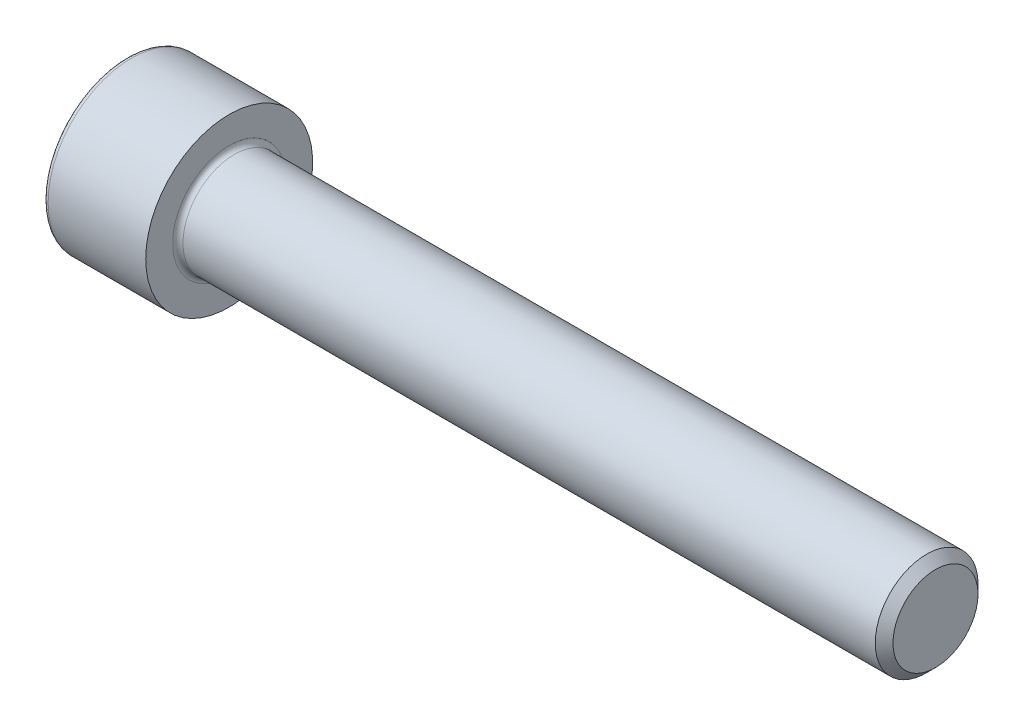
ISO-10303-21;
HEADER;
FILE_DESCRIPTION(('STEP AP214'),'2;1');
FILE_NAME('part.step','',(''),(''),'','','');
FILE_SCHEMA(('AUTOMOTIVE_DESIGN { 1 0 10303 214 1 1 1 1 }'));
ENDSEC;
DATA;
#1=APPLICATION_CONTEXT('core data for automotive mechanical design processes');
#2=APPLICATION_PROTOCOL_DEFINITION('international standard','automotive_design',2000,#1);
#3=PRODUCT_CONTEXT('',#1,'mechanical');
#4=PRODUCT('Part','Part','',(#3));
#5=PRODUCT_RELATED_PRODUCT_CATEGORY('part','',(#4));
#6=PRODUCT_DEFINITION_FORMATION('','',#4);
#7=PRODUCT_DEFINITION_CONTEXT('part definition',#1,'design');
#8=PRODUCT_DEFINITION('design','',#6,#7);
#9=PRODUCT_DEFINITION_SHAPE('','',#8);
#10=(LENGTH_UNIT() NAMED_UNIT(*) SI_UNIT(.MILLI.,.METRE.));
#11=(NAMED_UNIT(*) PLANE_ANGLE_UNIT() SI_UNIT($,.RADIAN.));
#12=(NAMED_UNIT(*) SI_UNIT($,.STERADIAN.) SOLID_ANGLE_UNIT());
#13=UNCERTAINTY_MEASURE_WITH_UNIT(LENGTH_MEASURE(1.E-05),#10,'distance_accuracy_value','');
#14=(GEOMETRIC_REPRESENTATION_CONTEXT(3) GLOBAL_UNCERTAINTY_ASSIGNED_CONTEXT((#13)) GLOBAL_UNIT_ASSIGNED_CONTEXT((#10,
#11,#12)) REPRESENTATION_CONTEXT('',''));
#15=CARTESIAN_POINT('',(0.,0.,0.));
#16=DIRECTION('',(0.,0.,1.));
#17=DIRECTION('',(1.,0.,0.));
#18=AXIS2_PLACEMENT_3D('',#15,#16,#17);
#19=CARTESIAN_POINT('',(0.,0.,0.));
#20=DIRECTION('',(-1.,0.,0.));
#21=DIRECTION('',(0.,0.,1.));
#22=AXIS2_PLACEMENT_3D('',#19,#20,#21);
#23=PLANE('',#22);
#24=DIRECTION('',(0.,-0.499999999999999,0.866025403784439));
#25=VECTOR('',#24,1.);
#26=CARTESIAN_POINT('',(0.,3.51894989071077,0.));
#27=LINE('',#26,#25);
#28=CARTESIAN_POINT('',(0.,3.51894989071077,0.));
#29=VERTEX_POINT('',#28);
#30=CARTESIAN_POINT('',(0.,1.75947494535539,3.04749999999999));
#31=VERTEX_POINT('',#30);
#32=EDGE_CURVE('E264',#29,#31,#27,.T.);
#33=ORIENTED_EDGE('',*,*,#32,.T.);
#34=DIRECTION('',(0.,1.,0.));
#35=VECTOR('',#34,1.);
#36=CARTESIAN_POINT('',(0.,-1.75947494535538,3.04749999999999));
#37=LINE('',#36,#35);
#38=CARTESIAN_POINT('',(0.,-1.75947494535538,3.04749999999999));
#39=VERTEX_POINT('',#38);
#40=EDGE_CURVE('E136',#39,#31,#37,.T.);
#41=ORIENTED_EDGE('',*,*,#40,.F.);
#42=DIRECTION('',(0.,-0.500000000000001,-0.866025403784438));
#43=VECTOR('',#42,1.);
#44=CARTESIAN_POINT('',(0.,-1.75947494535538,3.04749999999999));
#45=LINE('',#44,#43);
#46=CARTESIAN_POINT('',(0.,-3.51894989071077,0.));
#47=VERTEX_POINT('',#46);
#48=EDGE_CURVE('E267',#39,#47,#45,.T.);
#49=ORIENTED_EDGE('',*,*,#48,.T.);
#50=DIRECTION('',(0.,0.499999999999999,-0.866025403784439));
#51=VECTOR('',#50,1.);
#52=CARTESIAN_POINT('',(0.,-3.51894989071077,0.));
#53=LINE('',#52,#51);
#54=CARTESIAN_POINT('',(0.,-1.75947494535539,-3.04750000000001));
#55=VERTEX_POINT('',#54);
#56=EDGE_CURVE('E270',#47,#55,#53,.T.);
#57=ORIENTED_EDGE('',*,*,#56,.T.);
#58=DIRECTION('',(0.,-1.,0.));
#59=VECTOR('',#58,1.);
#60=CARTESIAN_POINT('',(0.,1.75947494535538,-3.04750000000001));
#61=LINE('',#60,#59);
#62=CARTESIAN_POINT('',(0.,1.75947494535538,-3.04750000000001));
#63=VERTEX_POINT('',#62);
#64=EDGE_CURVE('E273',#63,#55,#61,.T.);
#65=ORIENTED_EDGE('',*,*,#64,.F.);
#66=DIRECTION('',(0.,-0.500000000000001,-0.866025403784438));
#67=VECTOR('',#66,1.);
#68=CARTESIAN_POINT('',(0.,3.51894989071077,0.));
#69=LINE('',#68,#67);
#70=EDGE_CURVE('E131',#29,#63,#69,.T.);
#71=ORIENTED_EDGE('',*,*,#70,.F.);
#72=EDGE_LOOP('',(#33,#41,#49,#57,#65,#71));
#73=FACE_BOUND('',#72,.T.);
#74=CARTESIAN_POINT('',(0.,0.,0.));
#75=DIRECTION('',(-1.,0.,0.));
#76=DIRECTION('',(0.,0.,1.));
#77=AXIS2_PLACEMENT_3D('',#74,#75,#76);
#78=CIRCLE('',#77,6.1);
#79=CARTESIAN_POINT('',(0.,0.,6.1));
#80=VERTEX_POINT('',#79);
#81=EDGE_CURVE('E48',#80,#80,#78,.T.);
#82=ORIENTED_EDGE('',*,*,#81,.T.);
#83=EDGE_LOOP('',(#82));
#84=FACE_BOUND('',#83,.T.);
#85=ADVANCED_FACE('F40',(#73,#84),#23,.T.);
#86=CARTESIAN_POINT('',(-31.75,0.,0.));
#87=DIRECTION('',(-1.,0.,0.));
#88=DIRECTION('',(0.,0.,1.));
#89=AXIS2_PLACEMENT_3D('',#86,#87,#88);
#90=CYLINDRICAL_SURFACE('',#89,6.5);
#91=CARTESIAN_POINT('',(0.399999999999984,0.,0.));
#92=DIRECTION('',(-1.,0.,0.));
#93=DIRECTION('',(0.,0.,1.));
#94=AXIS2_PLACEMENT_3D('',#91,#92,#93);
#95=CIRCLE('',#94,6.5);
#96=CARTESIAN_POINT('',(0.399999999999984,0.,6.5));
#97=VERTEX_POINT('',#96);
#98=EDGE_CURVE('E11',#97,#97,#95,.F.);
#99=ORIENTED_EDGE('',*,*,#98,.T.);
#100=EDGE_LOOP('',(#99));
#101=FACE_BOUND('',#100,.T.);
#102=CARTESIAN_POINT('',(8.00000000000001,0.,0.));
#103=DIRECTION('',(-1.,0.,0.));
#104=DIRECTION('',(0.,0.,1.));
#105=AXIS2_PLACEMENT_3D('',#102,#103,#104);
#106=CIRCLE('',#105,6.5);
#107=CARTESIAN_POINT('',(8.00000000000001,0.,6.5));
#108=VERTEX_POINT('',#107);
#109=EDGE_CURVE('E154',#108,#108,#106,.T.);
#110=ORIENTED_EDGE('',*,*,#109,.T.);
#111=EDGE_LOOP('',(#110));
#112=FACE_BOUND('',#111,.T.);
#113=ADVANCED_FACE('F178',(#101,#112),#90,.T.);
#114=CARTESIAN_POINT('',(8.00000000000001,6.5,0.));
#115=DIRECTION('',(1.,0.,0.));
#116=DIRECTION('',(0.,0.,-1.));
#117=AXIS2_PLACEMENT_3D('',#114,#115,#116);
#118=PLANE('',#117);
#119=CARTESIAN_POINT('',(8.00000000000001,0.,0.));
#120=DIRECTION('',(1.,0.,0.));
#121=DIRECTION('',(0.,0.,-1.));
#122=AXIS2_PLACEMENT_3D('',#119,#120,#121);
#123=CIRCLE('',#122,4.4);
#124=CARTESIAN_POINT('',(8.00000000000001,0.,-4.4));
#125=VERTEX_POINT('',#124);
#126=EDGE_CURVE('E157',#125,#125,#123,.F.);
#127=ORIENTED_EDGE('',*,*,#126,.T.);
#128=EDGE_LOOP('',(#127));
#129=FACE_BOUND('',#128,.T.);
#130=ORIENTED_EDGE('',*,*,#109,.F.);
#131=EDGE_LOOP('',(#130));
#132=FACE_BOUND('',#131,.T.);
#133=ADVANCED_FACE('F184',(#129,#132),#118,.T.);
#134=CARTESIAN_POINT('',(-31.75,0.,0.));
#135=DIRECTION('',(-1.,0.,0.));
#136=DIRECTION('',(0.,0.,1.));
#137=AXIS2_PLACEMENT_3D('',#134,#135,#136);
#138=CYLINDRICAL_SURFACE('',#137,4.);
#139=CARTESIAN_POINT('',(8.39999999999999,0.,0.));
#140=DIRECTION('',(1.,0.,0.));
#141=DIRECTION('',(0.,0.,-1.));
#142=AXIS2_PLACEMENT_3D('',#139,#140,#141);
#143=CIRCLE('',#142,4.);
#144=CARTESIAN_POINT('',(8.39999999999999,0.,-4.));
#145=VERTEX_POINT('',#144);
#146=EDGE_CURVE('E160',#145,#145,#143,.T.);
#147=ORIENTED_EDGE('',*,*,#146,.T.);
#148=EDGE_LOOP('',(#147));
#149=FACE_BOUND('',#148,.T.);
#150=CARTESIAN_POINT('',(62.3095,0.,0.));
#151=DIRECTION('',(-1.,0.,0.));
#152=DIRECTION('',(0.,0.,1.));
#153=AXIS2_PLACEMENT_3D('',#150,#151,#152);
#154=CIRCLE('',#153,4.);
#155=CARTESIAN_POINT('',(62.3095,0.,4.));
#156=VERTEX_POINT('',#155);
#157=EDGE_CURVE('E151',#156,#156,#154,.T.);
#158=ORIENTED_EDGE('',*,*,#157,.T.);
#159=EDGE_LOOP('',(#158));
#160=FACE_BOUND('',#159,.T.);
#161=ADVANCED_FACE('F190',(#149,#160),#138,.T.);
#162=CARTESIAN_POINT('',(63.,0.,0.));
#163=DIRECTION('',(-1.,0.,0.));
#164=DIRECTION('',(0.,0.,1.));
#165=AXIS2_PLACEMENT_3D('',#162,#163,#164);
#166=CONICAL_SURFACE('',#165,3.3095,0.785398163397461);
#167=ORIENTED_EDGE('',*,*,#157,.F.);
#168=EDGE_LOOP('',(#167));
#169=FACE_BOUND('',#168,.T.);
#170=CARTESIAN_POINT('',(63.,0.,0.));
#171=DIRECTION('',(-1.,0.,0.));
#172=DIRECTION('',(0.,0.,1.));
#173=AXIS2_PLACEMENT_3D('',#170,#171,#172);
#174=CIRCLE('',#173,3.3095);
#175=CARTESIAN_POINT('',(63.,0.,3.3095));
#176=VERTEX_POINT('',#175);
#177=EDGE_CURVE('E147',#176,#176,#174,.T.);
#178=ORIENTED_EDGE('',*,*,#177,.T.);
#179=EDGE_LOOP('',(#178));
#180=FACE_BOUND('',#179,.T.);
#181=ADVANCED_FACE('F194',(#169,#180),#166,.T.);
#182=CARTESIAN_POINT('',(63.,3.3095,0.));
#183=DIRECTION('',(1.,0.,0.));
#184=DIRECTION('',(0.,0.,-1.));
#185=AXIS2_PLACEMENT_3D('',#182,#183,#184);
#186=PLANE('',#185);
#187=ORIENTED_EDGE('',*,*,#177,.F.);
#188=EDGE_LOOP('',(#187));
#189=FACE_BOUND('',#188,.T.);
#190=ADVANCED_FACE('F174',(#189),#186,.T.);
#191=CARTESIAN_POINT('',(8.39999999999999,0.,0.));
#192=DIRECTION('',(1.,0.,0.));
#193=DIRECTION('',(0.,0.,-1.));
#194=AXIS2_PLACEMENT_3D('',#191,#192,#193);
#195=TOROIDAL_SURFACE('',#194,4.4,0.4);
#196=ORIENTED_EDGE('',*,*,#146,.F.);
#197=EDGE_LOOP('',(#196));
#198=FACE_BOUND('',#197,.T.);
#199=ORIENTED_EDGE('',*,*,#126,.F.);
#200=EDGE_LOOP('',(#199));
#201=FACE_BOUND('',#200,.T.);
#202=ADVANCED_FACE('F167',(#198,#201),#195,.F.);
#203=CARTESIAN_POINT('',(0.399999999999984,0.,0.));
#204=DIRECTION('',(-1.,0.,0.));
#205=DIRECTION('',(0.,0.,1.));
#206=AXIS2_PLACEMENT_3D('',#203,#204,#205);
#207=TOROIDAL_SURFACE('',#206,6.1,0.4);
#208=ORIENTED_EDGE('',*,*,#98,.F.);
#209=EDGE_LOOP('',(#208));
#210=FACE_BOUND('',#209,.T.);
#211=ORIENTED_EDGE('',*,*,#81,.F.);
#212=EDGE_LOOP('',(#211));
#213=FACE_BOUND('',#212,.T.);
#214=ADVANCED_FACE('F42',(#210,#213),#207,.T.);
#215=CARTESIAN_POINT('',(4.,3.51894989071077,0.));
#216=DIRECTION('',(0.,-0.866025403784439,-0.499999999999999));
#217=DIRECTION('',(0.,0.499999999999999,-0.866025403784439));
#218=AXIS2_PLACEMENT_3D('',#215,#216,#217);
#219=PLANE('',#218);
#220=ORIENTED_EDGE('',*,*,#32,.F.);
#221=DIRECTION('',(-1.,0.,0.));
#222=VECTOR('',#221,1.);
#223=CARTESIAN_POINT('',(4.,3.51894989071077,0.));
#224=LINE('',#223,#222);
#225=CARTESIAN_POINT('',(4.,3.51894989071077,0.));
#226=VERTEX_POINT('',#225);
#227=EDGE_CURVE('E254',#226,#29,#224,.T.);
#228=ORIENTED_EDGE('',*,*,#227,.F.);
#229=DIRECTION('',(0.,-0.499999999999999,0.866025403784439));
#230=VECTOR('',#229,1.);
#231=CARTESIAN_POINT('',(4.,3.51894989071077,0.));
#232=LINE('',#231,#230);
#233=CARTESIAN_POINT('',(4.,2.63921241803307,1.52374999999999));
#234=VERTEX_POINT('',#233);
#235=EDGE_CURVE('E123',#226,#234,#232,.T.);
#236=ORIENTED_EDGE('',*,*,#235,.T.);
#237=CARTESIAN_POINT('',(4.,1.75947494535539,3.04749999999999));
#238=VERTEX_POINT('',#237);
#239=EDGE_CURVE('E114',#234,#238,#232,.T.);
#240=ORIENTED_EDGE('',*,*,#239,.T.);
#241=DIRECTION('',(-1.,0.,0.));
#242=VECTOR('',#241,1.);
#243=CARTESIAN_POINT('',(4.,1.75947494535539,3.04749999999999));
#244=LINE('',#243,#242);
#245=EDGE_CURVE('E128',#238,#31,#244,.T.);
#246=ORIENTED_EDGE('',*,*,#245,.T.);
#247=EDGE_LOOP('',(#220,#228,#236,#240,#246));
#248=FACE_BOUND('',#247,.T.);
#249=ADVANCED_FACE('F127',(#248),#219,.T.);
#250=CARTESIAN_POINT('',(4.,-1.75947494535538,3.04749999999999));
#251=DIRECTION('',(0.,0.,1.));
#252=DIRECTION('',(0.,-1.,0.));
#253=AXIS2_PLACEMENT_3D('',#250,#251,#252);
#254=PLANE('',#253);
#255=ORIENTED_EDGE('',*,*,#40,.T.);
#256=ORIENTED_EDGE('',*,*,#245,.F.);
#257=DIRECTION('',(0.,1.,0.));
#258=VECTOR('',#257,1.);
#259=CARTESIAN_POINT('',(4.,-1.75947494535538,3.04749999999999));
#260=LINE('',#259,#258);
#261=CARTESIAN_POINT('',(4.,0.,3.04749999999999));
#262=VERTEX_POINT('',#261);
#263=EDGE_CURVE('E111',#262,#238,#260,.T.);
#264=ORIENTED_EDGE('',*,*,#263,.F.);
#265=CARTESIAN_POINT('',(4.,-1.75947494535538,3.04749999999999));
#266=VERTEX_POINT('',#265);
#267=EDGE_CURVE('E122',#266,#262,#260,.T.);
#268=ORIENTED_EDGE('',*,*,#267,.F.);
#269=DIRECTION('',(-1.,0.,0.));
#270=VECTOR('',#269,1.);
#271=CARTESIAN_POINT('',(4.,-1.75947494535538,3.04749999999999));
#272=LINE('',#271,#270);
#273=EDGE_CURVE('E138',#266,#39,#272,.T.);
#274=ORIENTED_EDGE('',*,*,#273,.T.);
#275=EDGE_LOOP('',(#255,#256,#264,#268,#274));
#276=FACE_BOUND('',#275,.T.);
#277=ADVANCED_FACE('F133',(#276),#254,.F.);
#278=CARTESIAN_POINT('',(4.,-1.75947494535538,3.04749999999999));
#279=DIRECTION('',(0.,0.866025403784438,-0.500000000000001));
#280=DIRECTION('',(0.,0.500000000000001,0.866025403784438));
#281=AXIS2_PLACEMENT_3D('',#278,#279,#280);
#282=PLANE('',#281);
#283=ORIENTED_EDGE('',*,*,#48,.F.);
#284=ORIENTED_EDGE('',*,*,#273,.F.);
#285=DIRECTION('',(0.,-0.500000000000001,-0.866025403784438));
#286=VECTOR('',#285,1.);
#287=CARTESIAN_POINT('',(4.,-1.75947494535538,3.04749999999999));
#288=LINE('',#287,#286);
#289=CARTESIAN_POINT('',(4.,-2.63921241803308,1.52375));
#290=VERTEX_POINT('',#289);
#291=EDGE_CURVE('E293',#266,#290,#288,.T.);
#292=ORIENTED_EDGE('',*,*,#291,.T.);
#293=CARTESIAN_POINT('',(4.,-3.51894989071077,0.));
#294=VERTEX_POINT('',#293);
#295=EDGE_CURVE('E282',#290,#294,#288,.T.);
#296=ORIENTED_EDGE('',*,*,#295,.T.);
#297=DIRECTION('',(-1.,0.,0.));
#298=VECTOR('',#297,1.);
#299=CARTESIAN_POINT('',(4.,-3.51894989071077,0.));
#300=LINE('',#299,#298);
#301=EDGE_CURVE('E143',#294,#47,#300,.T.);
#302=ORIENTED_EDGE('',*,*,#301,.T.);
#303=EDGE_LOOP('',(#283,#284,#292,#296,#302));
#304=FACE_BOUND('',#303,.T.);
#305=ADVANCED_FACE('F208',(#304),#282,.T.);
#306=CARTESIAN_POINT('',(4.,-3.51894989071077,0.));
#307=DIRECTION('',(0.,0.866025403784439,0.499999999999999));
#308=DIRECTION('',(0.,-0.499999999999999,0.866025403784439));
#309=AXIS2_PLACEMENT_3D('',#306,#307,#308);
#310=PLANE('',#309);
#311=ORIENTED_EDGE('',*,*,#56,.F.);
#312=ORIENTED_EDGE('',*,*,#301,.F.);
#313=DIRECTION('',(0.,0.499999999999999,-0.866025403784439));
#314=VECTOR('',#313,1.);
#315=CARTESIAN_POINT('',(4.,-3.51894989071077,0.));
#316=LINE('',#315,#314);
#317=CARTESIAN_POINT('',(4.,-2.63921241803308,-1.52375));
#318=VERTEX_POINT('',#317);
#319=EDGE_CURVE('E260',#294,#318,#316,.T.);
#320=ORIENTED_EDGE('',*,*,#319,.T.);
#321=CARTESIAN_POINT('',(4.,-1.75947494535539,-3.04750000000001));
#322=VERTEX_POINT('',#321);
#323=EDGE_CURVE('E292',#318,#322,#316,.T.);
#324=ORIENTED_EDGE('',*,*,#323,.T.);
#325=DIRECTION('',(-1.,0.,0.));
#326=VECTOR('',#325,1.);
#327=CARTESIAN_POINT('',(4.,-1.75947494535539,-3.04750000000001));
#328=LINE('',#327,#326);
#329=EDGE_CURVE('E253',#322,#55,#328,.T.);
#330=ORIENTED_EDGE('',*,*,#329,.T.);
#331=EDGE_LOOP('',(#311,#312,#320,#324,#330));
#332=FACE_BOUND('',#331,.T.);
#333=ADVANCED_FACE('F211',(#332),#310,.T.);
#334=CARTESIAN_POINT('',(4.,1.75947494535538,-3.04750000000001));
#335=DIRECTION('',(0.,0.,-1.));
#336=DIRECTION('',(0.,1.,0.));
#337=AXIS2_PLACEMENT_3D('',#334,#335,#336);
#338=PLANE('',#337);
#339=ORIENTED_EDGE('',*,*,#64,.T.);
#340=ORIENTED_EDGE('',*,*,#329,.F.);
#341=DIRECTION('',(0.,-1.,0.));
#342=VECTOR('',#341,1.);
#343=CARTESIAN_POINT('',(4.,1.75947494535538,-3.04750000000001));
#344=LINE('',#343,#342);
#345=CARTESIAN_POINT('',(4.,0.,-3.04749999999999));
#346=VERTEX_POINT('',#345);
#347=EDGE_CURVE('E257',#346,#322,#344,.T.);
#348=ORIENTED_EDGE('',*,*,#347,.F.);
#349=CARTESIAN_POINT('',(4.,1.75947494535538,-3.04750000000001));
#350=VERTEX_POINT('',#349);
#351=EDGE_CURVE('E55',#350,#346,#344,.T.);
#352=ORIENTED_EDGE('',*,*,#351,.F.);
#353=DIRECTION('',(-1.,0.,0.));
#354=VECTOR('',#353,1.);
#355=CARTESIAN_POINT('',(4.,1.75947494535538,-3.04750000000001));
#356=LINE('',#355,#354);
#357=EDGE_CURVE('E250',#350,#63,#356,.T.);
#358=ORIENTED_EDGE('',*,*,#357,.T.);
#359=EDGE_LOOP('',(#339,#340,#348,#352,#358));
#360=FACE_BOUND('',#359,.T.);
#361=ADVANCED_FACE('F215',(#360),#338,.F.);
#362=CARTESIAN_POINT('',(4.,3.51894989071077,0.));
#363=DIRECTION('',(0.,0.866025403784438,-0.500000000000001));
#364=DIRECTION('',(0.,0.500000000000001,0.866025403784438));
#365=AXIS2_PLACEMENT_3D('',#362,#363,#364);
#366=PLANE('',#365);
#367=ORIENTED_EDGE('',*,*,#70,.T.);
#368=ORIENTED_EDGE('',*,*,#357,.F.);
#369=DIRECTION('',(0.,-0.500000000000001,-0.866025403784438));
#370=VECTOR('',#369,1.);
#371=CARTESIAN_POINT('',(4.,3.51894989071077,0.));
#372=LINE('',#371,#370);
#373=CARTESIAN_POINT('',(4.,2.63921241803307,-1.52375));
#374=VERTEX_POINT('',#373);
#375=EDGE_CURVE('E240',#374,#350,#372,.T.);
#376=ORIENTED_EDGE('',*,*,#375,.F.);
#377=EDGE_CURVE('E246',#226,#374,#372,.T.);
#378=ORIENTED_EDGE('',*,*,#377,.F.);
#379=ORIENTED_EDGE('',*,*,#227,.T.);
#380=EDGE_LOOP('',(#367,#368,#376,#378,#379));
#381=FACE_BOUND('',#380,.T.);
#382=ADVANCED_FACE('F219',(#381),#366,.F.);
#383=CARTESIAN_POINT('',(4.,5.27842483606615,-3.04750000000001));
#384=DIRECTION('',(1.,0.,0.));
#385=DIRECTION('',(0.,0.,-1.));
#386=AXIS2_PLACEMENT_3D('',#383,#384,#385);
#387=PLANE('',#386);
#388=ORIENTED_EDGE('',*,*,#347,.T.);
#389=ORIENTED_EDGE('',*,*,#323,.F.);
#390=CARTESIAN_POINT('',(4.,0.,0.));
#391=DIRECTION('',(-1.,0.,0.));
#392=DIRECTION('',(0.,0.,1.));
#393=AXIS2_PLACEMENT_3D('',#390,#391,#392);
#394=CIRCLE('',#393,3.0475);
#395=EDGE_CURVE('E288',#346,#318,#394,.T.);
#396=ORIENTED_EDGE('',*,*,#395,.F.);
#397=EDGE_LOOP('',(#388,#389,#396));
#398=FACE_BOUND('',#397,.T.);
#399=ADVANCED_FACE('F223',(#398),#387,.F.);
#400=ORIENTED_EDGE('',*,*,#319,.F.);
#401=ORIENTED_EDGE('',*,*,#295,.F.);
#402=EDGE_CURVE('E141',#318,#290,#394,.T.);
#403=ORIENTED_EDGE('',*,*,#402,.F.);
#404=EDGE_LOOP('',(#400,#401,#403));
#405=FACE_BOUND('',#404,.T.);
#406=ADVANCED_FACE('F226',(#405),#387,.F.);
#407=ORIENTED_EDGE('',*,*,#291,.F.);
#408=ORIENTED_EDGE('',*,*,#267,.T.);
#409=EDGE_CURVE('E137',#290,#262,#394,.T.);
#410=ORIENTED_EDGE('',*,*,#409,.F.);
#411=EDGE_LOOP('',(#407,#408,#410));
#412=FACE_BOUND('',#411,.T.);
#413=ADVANCED_FACE('F231',(#412),#387,.F.);
#414=ORIENTED_EDGE('',*,*,#263,.T.);
#415=ORIENTED_EDGE('',*,*,#239,.F.);
#416=EDGE_CURVE('E117',#262,#234,#394,.T.);
#417=ORIENTED_EDGE('',*,*,#416,.F.);
#418=EDGE_LOOP('',(#414,#415,#417));
#419=FACE_BOUND('',#418,.T.);
#420=ADVANCED_FACE('F113',(#419),#387,.F.);
#421=ORIENTED_EDGE('',*,*,#235,.F.);
#422=ORIENTED_EDGE('',*,*,#377,.T.);
#423=EDGE_CURVE('E148',#234,#374,#394,.T.);
#424=ORIENTED_EDGE('',*,*,#423,.F.);
#425=EDGE_LOOP('',(#421,#422,#424));
#426=FACE_BOUND('',#425,.T.);
#427=ADVANCED_FACE('F234',(#426),#387,.F.);
#428=ORIENTED_EDGE('',*,*,#375,.T.);
#429=ORIENTED_EDGE('',*,*,#351,.T.);
#430=EDGE_CURVE('E243',#374,#346,#394,.T.);
#431=ORIENTED_EDGE('',*,*,#430,.F.);
#432=EDGE_LOOP('',(#428,#429,#431));
#433=FACE_BOUND('',#432,.T.);
#434=ADVANCED_FACE('F204',(#433),#387,.F.);
#435=CARTESIAN_POINT('',(4.,0.,0.));
#436=DIRECTION('',(-1.,0.,0.));
#437=DIRECTION('',(0.,0.,1.));
#438=AXIS2_PLACEMENT_3D('',#435,#436,#437);
#439=CONICAL_SURFACE('',#438,3.0475,1.04719755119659);
#440=CARTESIAN_POINT('',(5.75947494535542,0.,0.));
#441=VERTEX_POINT('',#440);
#442=VERTEX_LOOP('',#441);
#443=FACE_BOUND('',#442,.T.);
#444=ORIENTED_EDGE('',*,*,#416,.T.);
#445=ORIENTED_EDGE('',*,*,#423,.T.);
#446=ORIENTED_EDGE('',*,*,#430,.T.);
#447=ORIENTED_EDGE('',*,*,#395,.T.);
#448=ORIENTED_EDGE('',*,*,#402,.T.);
#449=ORIENTED_EDGE('',*,*,#409,.T.);
#450=EDGE_LOOP('',(#444,#445,#446,#447,#448,#449));
#451=FACE_BOUND('',#450,.T.);
#452=ADVANCED_FACE('F202',(#443,#451),#439,.F.);
#453=CLOSED_SHELL('',(#85,#113,#133,#161,#181,#190,#202,#214,#249,#277,#305,#333,#361,#382,#399,
#406,#413,#420,#427,#434,#452));
#454=MANIFOLD_SOLID_BREP('B2',#453);
#455=ADVANCED_BREP_SHAPE_REPRESENTATION('',(#18,#454),#14);
#456=SHAPE_DEFINITION_REPRESENTATION(#9,#455);
ENDSEC;
END-ISO-10303-21;
